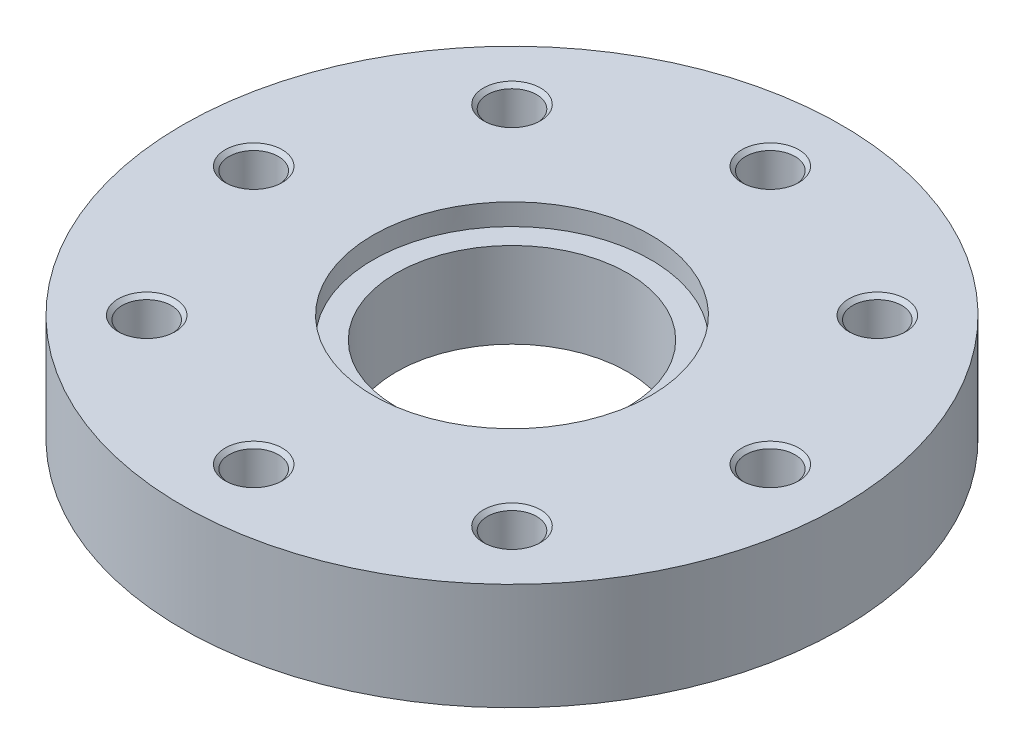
ISO-10303-21;
HEADER;
FILE_DESCRIPTION(('STEP AP214'),'2;1');
FILE_NAME('part.step','',(''),(''),'','','');
FILE_SCHEMA(('AUTOMOTIVE_DESIGN { 1 0 10303 214 1 1 1 1 }'));
ENDSEC;
DATA;
#1=APPLICATION_CONTEXT('core data for automotive mechanical design processes');
#2=APPLICATION_PROTOCOL_DEFINITION('international standard','automotive_design',2000,#1);
#3=PRODUCT_CONTEXT('',#1,'mechanical');
#4=PRODUCT('Part','Part','',(#3));
#5=PRODUCT_RELATED_PRODUCT_CATEGORY('part','',(#4));
#6=PRODUCT_DEFINITION_FORMATION('','',#4);
#7=PRODUCT_DEFINITION_CONTEXT('part definition',#1,'design');
#8=PRODUCT_DEFINITION('design','',#6,#7);
#9=PRODUCT_DEFINITION_SHAPE('','',#8);
#10=(LENGTH_UNIT() NAMED_UNIT(*) SI_UNIT(.MILLI.,.METRE.));
#11=(NAMED_UNIT(*) PLANE_ANGLE_UNIT() SI_UNIT($,.RADIAN.));
#12=(NAMED_UNIT(*) SI_UNIT($,.STERADIAN.) SOLID_ANGLE_UNIT());
#13=UNCERTAINTY_MEASURE_WITH_UNIT(LENGTH_MEASURE(1.E-05),#10,'distance_accuracy_value','');
#14=(GEOMETRIC_REPRESENTATION_CONTEXT(3) GLOBAL_UNCERTAINTY_ASSIGNED_CONTEXT((#13)) GLOBAL_UNIT_ASSIGNED_CONTEXT((#10,
#11,#12)) REPRESENTATION_CONTEXT('',''));
#15=CARTESIAN_POINT('',(0.,0.,0.));
#16=DIRECTION('',(0.,0.,1.));
#17=DIRECTION('',(1.,0.,0.));
#18=AXIS2_PLACEMENT_3D('',#15,#16,#17);
#19=CARTESIAN_POINT('',(0.,15.,0.));
#20=DIRECTION('',(0.,-1.,0.));
#21=DIRECTION('',(1.,0.,0.));
#22=AXIS2_PLACEMENT_3D('',#19,#20,#21);
#23=CYLINDRICAL_SURFACE('',#22,92.5);
#24=CARTESIAN_POINT('',(0.,0.,0.));
#25=DIRECTION('',(0.,1.,0.));
#26=DIRECTION('',(1.,0.,0.));
#27=AXIS2_PLACEMENT_3D('',#24,#25,#26);
#28=CIRCLE('',#27,92.5);
#29=CARTESIAN_POINT('',(92.5,0.,0.));
#30=VERTEX_POINT('',#29);
#31=EDGE_CURVE('E9',#30,#30,#28,.T.);
#32=ORIENTED_EDGE('',*,*,#31,.T.);
#33=EDGE_LOOP('',(#32));
#34=FACE_BOUND('',#33,.T.);
#35=CARTESIAN_POINT('',(0.,30.,0.));
#36=DIRECTION('',(0.,1.,0.));
#37=DIRECTION('',(1.,0.,0.));
#38=AXIS2_PLACEMENT_3D('',#35,#36,#37);
#39=CIRCLE('',#38,92.5);
#40=CARTESIAN_POINT('',(92.5,30.,0.));
#41=VERTEX_POINT('',#40);
#42=EDGE_CURVE('E317',#41,#41,#39,.T.);
#43=ORIENTED_EDGE('',*,*,#42,.F.);
#44=EDGE_LOOP('',(#43));
#45=FACE_BOUND('',#44,.T.);
#46=ADVANCED_FACE('F15',(#34,#45),#23,.T.);
#47=CARTESIAN_POINT('',(62.5,0.,0.));
#48=DIRECTION('',(0.,-1.,0.));
#49=DIRECTION('',(-1.,0.,0.));
#50=AXIS2_PLACEMENT_3D('',#47,#48,#49);
#51=PLANE('',#50);
#52=CARTESIAN_POINT('',(0.,0.,0.));
#53=DIRECTION('',(0.,1.,0.));
#54=DIRECTION('',(1.,0.,0.));
#55=AXIS2_PLACEMENT_3D('',#52,#53,#54);
#56=CIRCLE('',#55,32.5);
#57=CARTESIAN_POINT('',(32.5,0.,0.));
#58=VERTEX_POINT('',#57);
#59=EDGE_CURVE('E18',#58,#58,#56,.T.);
#60=ORIENTED_EDGE('',*,*,#59,.T.);
#61=EDGE_LOOP('',(#60));
#62=FACE_BOUND('',#61,.T.);
#63=ORIENTED_EDGE('',*,*,#31,.F.);
#64=EDGE_LOOP('',(#63));
#65=FACE_BOUND('',#64,.T.);
#66=ADVANCED_FACE('F323',(#62,#65),#51,.T.);
#67=CARTESIAN_POINT('',(0.,15.,0.));
#68=DIRECTION('',(0.,-1.,0.));
#69=DIRECTION('',(1.,0.,0.));
#70=AXIS2_PLACEMENT_3D('',#67,#68,#69);
#71=CYLINDRICAL_SURFACE('',#70,32.5);
#72=ORIENTED_EDGE('',*,*,#59,.F.);
#73=EDGE_LOOP('',(#72));
#74=FACE_BOUND('',#73,.T.);
#75=CARTESIAN_POINT('',(0.,24.,0.));
#76=DIRECTION('',(0.,1.,0.));
#77=DIRECTION('',(1.,0.,0.));
#78=AXIS2_PLACEMENT_3D('',#75,#76,#77);
#79=CIRCLE('',#78,32.5);
#80=CARTESIAN_POINT('',(-32.5,24.,0.));
#81=VERTEX_POINT('',#80);
#82=EDGE_CURVE('E295',#81,#81,#79,.T.);
#83=ORIENTED_EDGE('',*,*,#82,.T.);
#84=EDGE_LOOP('',(#83));
#85=FACE_BOUND('',#84,.T.);
#86=ADVANCED_FACE('F328',(#74,#85),#71,.F.);
#87=CARTESIAN_POINT('',(62.5,30.,0.));
#88=DIRECTION('',(0.,1.,0.));
#89=DIRECTION('',(1.,0.,0.));
#90=AXIS2_PLACEMENT_3D('',#87,#88,#89);
#91=PLANE('',#90);
#92=ORIENTED_EDGE('',*,*,#42,.T.);
#93=EDGE_LOOP('',(#92));
#94=FACE_BOUND('',#93,.T.);
#95=CARTESIAN_POINT('',(0.,30.,0.));
#96=DIRECTION('',(0.,-1.,0.));
#97=DIRECTION('',(1.,0.,0.));
#98=AXIS2_PLACEMENT_3D('',#95,#96,#97);
#99=CIRCLE('',#98,39.);
#100=CARTESIAN_POINT('',(-39.,30.,0.));
#101=VERTEX_POINT('',#100);
#102=EDGE_CURVE('E287',#101,#101,#99,.T.);
#103=ORIENTED_EDGE('',*,*,#102,.T.);
#104=EDGE_LOOP('',(#103));
#105=FACE_BOUND('',#104,.T.);
#106=CARTESIAN_POINT('',(72.5,30.,0.));
#107=DIRECTION('',(0.,-1.,0.));
#108=DIRECTION('',(1.,0.,0.));
#109=AXIS2_PLACEMENT_3D('',#106,#107,#108);
#110=CIRCLE('',#109,8.);
#111=CARTESIAN_POINT('',(80.5,30.,0.));
#112=VERTEX_POINT('',#111);
#113=EDGE_CURVE('E238',#112,#112,#110,.T.);
#114=ORIENTED_EDGE('',*,*,#113,.T.);
#115=EDGE_LOOP('',(#114));
#116=FACE_BOUND('',#115,.T.);
#117=CARTESIAN_POINT('',(51.2652416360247,30.,-51.2652416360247));
#118=DIRECTION('',(0.,-1.,0.));
#119=DIRECTION('',(0.707106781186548,0.,-0.707106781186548));
#120=AXIS2_PLACEMENT_3D('',#117,#118,#119);
#121=CIRCLE('',#120,8.);
#122=CARTESIAN_POINT('',(56.9220958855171,30.,-56.9220958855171));
#123=VERTEX_POINT('',#122);
#124=EDGE_CURVE('E264',#123,#123,#121,.T.);
#125=ORIENTED_EDGE('',*,*,#124,.T.);
#126=EDGE_LOOP('',(#125));
#127=FACE_BOUND('',#126,.T.);
#128=CARTESIAN_POINT('',(0.,30.,-72.5));
#129=DIRECTION('',(0.,-1.,0.));
#130=DIRECTION('',(0.,0.,-1.));
#131=AXIS2_PLACEMENT_3D('',#128,#129,#130);
#132=CIRCLE('',#131,8.);
#133=CARTESIAN_POINT('',(0.,30.,-80.5));
#134=VERTEX_POINT('',#133);
#135=EDGE_CURVE('E292',#134,#134,#132,.T.);
#136=ORIENTED_EDGE('',*,*,#135,.T.);
#137=EDGE_LOOP('',(#136));
#138=FACE_BOUND('',#137,.T.);
#139=CARTESIAN_POINT('',(-51.2652416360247,30.,-51.2652416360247));
#140=DIRECTION('',(0.,-1.,0.));
#141=DIRECTION('',(-0.707106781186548,0.,-0.707106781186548));
#142=AXIS2_PLACEMENT_3D('',#139,#140,#141);
#143=CIRCLE('',#142,8.);
#144=CARTESIAN_POINT('',(-56.9220958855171,30.,-56.9220958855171));
#145=VERTEX_POINT('',#144);
#146=EDGE_CURVE('E275',#145,#145,#143,.T.);
#147=ORIENTED_EDGE('',*,*,#146,.T.);
#148=EDGE_LOOP('',(#147));
#149=FACE_BOUND('',#148,.T.);
#150=CARTESIAN_POINT('',(-72.5,30.,0.));
#151=DIRECTION('',(0.,-1.,0.));
#152=DIRECTION('',(-1.,0.,0.));
#153=AXIS2_PLACEMENT_3D('',#150,#151,#152);
#154=CIRCLE('',#153,8.);
#155=CARTESIAN_POINT('',(-80.5,30.,0.));
#156=VERTEX_POINT('',#155);
#157=EDGE_CURVE('E258',#156,#156,#154,.T.);
#158=ORIENTED_EDGE('',*,*,#157,.T.);
#159=EDGE_LOOP('',(#158));
#160=FACE_BOUND('',#159,.T.);
#161=CARTESIAN_POINT('',(-51.2652416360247,30.,51.2652416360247));
#162=DIRECTION('',(0.,-1.,0.));
#163=DIRECTION('',(-0.707106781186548,0.,0.707106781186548));
#164=AXIS2_PLACEMENT_3D('',#161,#162,#163);
#165=CIRCLE('',#164,8.);
#166=CARTESIAN_POINT('',(-56.9220958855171,30.,56.9220958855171));
#167=VERTEX_POINT('',#166);
#168=EDGE_CURVE('E231',#167,#167,#165,.T.);
#169=ORIENTED_EDGE('',*,*,#168,.T.);
#170=EDGE_LOOP('',(#169));
#171=FACE_BOUND('',#170,.T.);
#172=CARTESIAN_POINT('',(0.,30.,72.5));
#173=DIRECTION('',(0.,-1.,0.));
#174=DIRECTION('',(0.,0.,1.));
#175=AXIS2_PLACEMENT_3D('',#172,#173,#174);
#176=CIRCLE('',#175,8.);
#177=CARTESIAN_POINT('',(0.,30.,80.5));
#178=VERTEX_POINT('',#177);
#179=EDGE_CURVE('E212',#178,#178,#176,.T.);
#180=ORIENTED_EDGE('',*,*,#179,.T.);
#181=EDGE_LOOP('',(#180));
#182=FACE_BOUND('',#181,.T.);
#183=CARTESIAN_POINT('',(51.2652416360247,30.,51.2652416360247));
#184=DIRECTION('',(0.,-1.,0.));
#185=DIRECTION('',(0.707106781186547,0.,0.707106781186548));
#186=AXIS2_PLACEMENT_3D('',#183,#184,#185);
#187=CIRCLE('',#186,8.);
#188=CARTESIAN_POINT('',(56.9220958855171,30.,56.9220958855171));
#189=VERTEX_POINT('',#188);
#190=EDGE_CURVE('E228',#189,#189,#187,.T.);
#191=ORIENTED_EDGE('',*,*,#190,.T.);
#192=EDGE_LOOP('',(#191));
#193=FACE_BOUND('',#192,.T.);
#194=ADVANCED_FACE('F213',(#94,#105,#116,#127,#138,#149,#160,#171,#182,#193),#91,.T.);
#195=CARTESIAN_POINT('',(0.,24.,0.));
#196=DIRECTION('',(0.,-1.,0.));
#197=DIRECTION('',(-1.,0.,0.));
#198=AXIS2_PLACEMENT_3D('',#195,#196,#197);
#199=PLANE('',#198);
#200=CARTESIAN_POINT('',(0.,24.,0.));
#201=DIRECTION('',(0.,-1.,0.));
#202=DIRECTION('',(1.,0.,0.));
#203=AXIS2_PLACEMENT_3D('',#200,#201,#202);
#204=CIRCLE('',#203,39.);
#205=CARTESIAN_POINT('',(39.,24.,0.));
#206=VERTEX_POINT('',#205);
#207=EDGE_CURVE('E293',#206,#206,#204,.T.);
#208=ORIENTED_EDGE('',*,*,#207,.F.);
#209=EDGE_LOOP('',(#208));
#210=FACE_BOUND('',#209,.T.);
#211=ORIENTED_EDGE('',*,*,#82,.F.);
#212=EDGE_LOOP('',(#211));
#213=FACE_BOUND('',#212,.T.);
#214=ADVANCED_FACE('F338',(#210,#213),#199,.F.);
#215=CARTESIAN_POINT('',(0.,28.5,0.));
#216=DIRECTION('',(0.,-1.,0.));
#217=DIRECTION('',(1.,0.,0.));
#218=AXIS2_PLACEMENT_3D('',#215,#216,#217);
#219=CYLINDRICAL_SURFACE('',#218,39.);
#220=ORIENTED_EDGE('',*,*,#207,.T.);
#221=EDGE_LOOP('',(#220));
#222=FACE_BOUND('',#221,.T.);
#223=ORIENTED_EDGE('',*,*,#102,.F.);
#224=EDGE_LOOP('',(#223));
#225=FACE_BOUND('',#224,.T.);
#226=ADVANCED_FACE('F341',(#222,#225),#219,.F.);
#227=CARTESIAN_POINT('',(72.5,5.00308975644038,0.));
#228=DIRECTION('',(0.,1.,0.));
#229=DIRECTION('',(1.,0.,0.));
#230=AXIS2_PLACEMENT_3D('',#227,#228,#229);
#231=CONICAL_SURFACE('',#230,3.45875,1.0471975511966);
#232=CARTESIAN_POINT('',(72.5,7.,0.));
#233=DIRECTION('',(0.,-1.,0.));
#234=DIRECTION('',(1.,0.,0.));
#235=AXIS2_PLACEMENT_3D('',#232,#233,#234);
#236=CIRCLE('',#235,6.9175);
#237=CARTESIAN_POINT('',(79.4175,7.,0.));
#238=VERTEX_POINT('',#237);
#239=EDGE_CURVE('E285',#238,#238,#236,.T.);
#240=ORIENTED_EDGE('',*,*,#239,.F.);
#241=EDGE_LOOP('',(#240));
#242=FACE_BOUND('',#241,.T.);
#243=CARTESIAN_POINT('',(72.5,3.00617951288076,0.));
#244=VERTEX_POINT('',#243);
#245=VERTEX_LOOP('',#244);
#246=FACE_BOUND('',#245,.T.);
#247=ADVANCED_FACE('F343',(#242,#246),#231,.F.);
#248=CARTESIAN_POINT('',(72.5,9.95875,0.));
#249=DIRECTION('',(0.,1.,0.));
#250=DIRECTION('',(1.,0.,0.));
#251=AXIS2_PLACEMENT_3D('',#248,#249,#250);
#252=CYLINDRICAL_SURFACE('',#251,6.9175);
#253=CARTESIAN_POINT('',(72.5,12.9175,0.));
#254=DIRECTION('',(0.,-1.,0.));
#255=DIRECTION('',(1.,0.,0.));
#256=AXIS2_PLACEMENT_3D('',#253,#254,#255);
#257=CIRCLE('',#256,6.9175);
#258=CARTESIAN_POINT('',(79.4175,12.9175,0.));
#259=VERTEX_POINT('',#258);
#260=EDGE_CURVE('E288',#259,#259,#257,.T.);
#261=ORIENTED_EDGE('',*,*,#260,.F.);
#262=EDGE_LOOP('',(#261));
#263=FACE_BOUND('',#262,.T.);
#264=ORIENTED_EDGE('',*,*,#239,.T.);
#265=EDGE_LOOP('',(#264));
#266=FACE_BOUND('',#265,.T.);
#267=ADVANCED_FACE('F346',(#263,#266),#252,.F.);
#268=CARTESIAN_POINT('',(72.5,13.45875,0.));
#269=DIRECTION('',(0.,1.,0.));
#270=DIRECTION('',(1.,0.,0.));
#271=AXIS2_PLACEMENT_3D('',#268,#269,#270);
#272=CONICAL_SURFACE('',#271,7.45875,0.785398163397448);
#273=CARTESIAN_POINT('',(72.5,14.,0.));
#274=DIRECTION('',(0.,-1.,0.));
#275=DIRECTION('',(1.,0.,0.));
#276=AXIS2_PLACEMENT_3D('',#273,#274,#275);
#277=CIRCLE('',#276,8.);
#278=CARTESIAN_POINT('',(80.5,14.,0.));
#279=VERTEX_POINT('',#278);
#280=EDGE_CURVE('E313',#279,#279,#277,.T.);
#281=ORIENTED_EDGE('',*,*,#280,.F.);
#282=EDGE_LOOP('',(#281));
#283=FACE_BOUND('',#282,.T.);
#284=ORIENTED_EDGE('',*,*,#260,.T.);
#285=EDGE_LOOP('',(#284));
#286=FACE_BOUND('',#285,.T.);
#287=ADVANCED_FACE('F350',(#283,#286),#272,.F.);
#288=CARTESIAN_POINT('',(79.95875,14.,0.));
#289=DIRECTION('',(0.,1.,0.));
#290=DIRECTION('',(-1.,0.,0.));
#291=AXIS2_PLACEMENT_3D('',#288,#289,#290);
#292=PLANE('',#291);
#293=CARTESIAN_POINT('',(72.5,14.,0.));
#294=DIRECTION('',(0.,-1.,0.));
#295=DIRECTION('',(1.,0.,0.));
#296=AXIS2_PLACEMENT_3D('',#293,#294,#295);
#297=CIRCLE('',#296,6.9175);
#298=CARTESIAN_POINT('',(79.4175,14.,0.));
#299=VERTEX_POINT('',#298);
#300=EDGE_CURVE('E239',#299,#299,#297,.T.);
#301=ORIENTED_EDGE('',*,*,#300,.F.);
#302=EDGE_LOOP('',(#301));
#303=FACE_BOUND('',#302,.T.);
#304=ORIENTED_EDGE('',*,*,#280,.T.);
#305=EDGE_LOOP('',(#304));
#306=FACE_BOUND('',#305,.T.);
#307=ADVANCED_FACE('F354',(#303,#306),#292,.F.);
#308=CARTESIAN_POINT('',(72.5,21.45875,0.));
#309=DIRECTION('',(0.,1.,0.));
#310=DIRECTION('',(1.,0.,0.));
#311=AXIS2_PLACEMENT_3D('',#308,#309,#310);
#312=CYLINDRICAL_SURFACE('',#311,6.9175);
#313=CARTESIAN_POINT('',(72.5,28.9175,0.));
#314=DIRECTION('',(0.,-1.,0.));
#315=DIRECTION('',(1.,0.,0.));
#316=AXIS2_PLACEMENT_3D('',#313,#314,#315);
#317=CIRCLE('',#316,6.9175);
#318=CARTESIAN_POINT('',(79.4175,28.9175,0.));
#319=VERTEX_POINT('',#318);
#320=EDGE_CURVE('E240',#319,#319,#317,.T.);
#321=ORIENTED_EDGE('',*,*,#320,.F.);
#322=EDGE_LOOP('',(#321));
#323=FACE_BOUND('',#322,.T.);
#324=ORIENTED_EDGE('',*,*,#300,.T.);
#325=EDGE_LOOP('',(#324));
#326=FACE_BOUND('',#325,.T.);
#327=ADVANCED_FACE('F358',(#323,#326),#312,.F.);
#328=CARTESIAN_POINT('',(72.5,29.45875,0.));
#329=DIRECTION('',(0.,1.,0.));
#330=DIRECTION('',(1.,0.,0.));
#331=AXIS2_PLACEMENT_3D('',#328,#329,#330);
#332=CONICAL_SURFACE('',#331,7.45875,0.785398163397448);
#333=ORIENTED_EDGE('',*,*,#113,.F.);
#334=EDGE_LOOP('',(#333));
#335=FACE_BOUND('',#334,.T.);
#336=ORIENTED_EDGE('',*,*,#320,.T.);
#337=EDGE_LOOP('',(#336));
#338=FACE_BOUND('',#337,.T.);
#339=ADVANCED_FACE('F360',(#335,#338),#332,.F.);
#340=CARTESIAN_POINT('',(51.2652416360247,5.00308975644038,-51.2652416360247));
#341=DIRECTION('',(0.,1.,0.));
#342=DIRECTION('',(0.707106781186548,0.,-0.707106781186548));
#343=AXIS2_PLACEMENT_3D('',#340,#341,#342);
#344=CONICAL_SURFACE('',#343,3.45875,1.0471975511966);
#345=CARTESIAN_POINT('',(51.2652416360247,7.,-51.2652416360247));
#346=DIRECTION('',(0.,-1.,0.));
#347=DIRECTION('',(0.707106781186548,0.,-0.707106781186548));
#348=AXIS2_PLACEMENT_3D('',#345,#346,#347);
#349=CIRCLE('',#348,6.9175);
#350=CARTESIAN_POINT('',(56.1566527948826,7.,-56.1566527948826));
#351=VERTEX_POINT('',#350);
#352=EDGE_CURVE('E274',#351,#351,#349,.T.);
#353=ORIENTED_EDGE('',*,*,#352,.F.);
#354=EDGE_LOOP('',(#353));
#355=FACE_BOUND('',#354,.T.);
#356=CARTESIAN_POINT('',(51.2652416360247,3.00617951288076,-51.2652416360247));
#357=VERTEX_POINT('',#356);
#358=VERTEX_LOOP('',#357);
#359=FACE_BOUND('',#358,.T.);
#360=ADVANCED_FACE('F363',(#355,#359),#344,.F.);
#361=CARTESIAN_POINT('',(51.2652416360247,9.95875,-51.2652416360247));
#362=DIRECTION('',(0.,1.,0.));
#363=DIRECTION('',(0.707106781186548,0.,-0.707106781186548));
#364=AXIS2_PLACEMENT_3D('',#361,#362,#363);
#365=CYLINDRICAL_SURFACE('',#364,6.9175);
#366=CARTESIAN_POINT('',(51.2652416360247,12.9175,-51.2652416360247));
#367=DIRECTION('',(0.,-1.,0.));
#368=DIRECTION('',(0.707106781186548,0.,-0.707106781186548));
#369=AXIS2_PLACEMENT_3D('',#366,#367,#368);
#370=CIRCLE('',#369,6.9175);
#371=CARTESIAN_POINT('',(56.1566527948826,12.9175,-56.1566527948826));
#372=VERTEX_POINT('',#371);
#373=EDGE_CURVE('E309',#372,#372,#370,.T.);
#374=ORIENTED_EDGE('',*,*,#373,.F.);
#375=EDGE_LOOP('',(#374));
#376=FACE_BOUND('',#375,.T.);
#377=ORIENTED_EDGE('',*,*,#352,.T.);
#378=EDGE_LOOP('',(#377));
#379=FACE_BOUND('',#378,.T.);
#380=ADVANCED_FACE('F367',(#376,#379),#365,.F.);
#381=CARTESIAN_POINT('',(51.2652416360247,13.45875,-51.2652416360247));
#382=DIRECTION('',(0.,1.,0.));
#383=DIRECTION('',(0.707106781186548,0.,-0.707106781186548));
#384=AXIS2_PLACEMENT_3D('',#381,#382,#383);
#385=CONICAL_SURFACE('',#384,7.45875,0.785398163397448);
#386=CARTESIAN_POINT('',(51.2652416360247,14.,-51.2652416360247));
#387=DIRECTION('',(0.,-1.,0.));
#388=DIRECTION('',(0.707106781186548,0.,-0.707106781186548));
#389=AXIS2_PLACEMENT_3D('',#386,#387,#388);
#390=CIRCLE('',#389,8.);
#391=CARTESIAN_POINT('',(56.9220958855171,14.,-56.9220958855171));
#392=VERTEX_POINT('',#391);
#393=EDGE_CURVE('E263',#392,#392,#390,.T.);
#394=ORIENTED_EDGE('',*,*,#393,.F.);
#395=EDGE_LOOP('',(#394));
#396=FACE_BOUND('',#395,.T.);
#397=ORIENTED_EDGE('',*,*,#373,.T.);
#398=EDGE_LOOP('',(#397));
#399=FACE_BOUND('',#398,.T.);
#400=ADVANCED_FACE('F371',(#396,#399),#385,.F.);
#401=CARTESIAN_POINT('',(56.5393743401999,14.,-56.5393743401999));
#402=DIRECTION('',(0.,1.,0.));
#403=DIRECTION('',(-0.707106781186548,0.,0.707106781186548));
#404=AXIS2_PLACEMENT_3D('',#401,#402,#403);
#405=PLANE('',#404);
#406=CARTESIAN_POINT('',(51.2652416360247,14.,-51.2652416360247));
#407=DIRECTION('',(0.,-1.,0.));
#408=DIRECTION('',(0.707106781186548,0.,-0.707106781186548));
#409=AXIS2_PLACEMENT_3D('',#406,#407,#408);
#410=CIRCLE('',#409,6.9175);
#411=CARTESIAN_POINT('',(56.1566527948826,14.,-56.1566527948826));
#412=VERTEX_POINT('',#411);
#413=EDGE_CURVE('E261',#412,#412,#410,.T.);
#414=ORIENTED_EDGE('',*,*,#413,.F.);
#415=EDGE_LOOP('',(#414));
#416=FACE_BOUND('',#415,.T.);
#417=ORIENTED_EDGE('',*,*,#393,.T.);
#418=EDGE_LOOP('',(#417));
#419=FACE_BOUND('',#418,.T.);
#420=ADVANCED_FACE('F373',(#416,#419),#405,.F.);
#421=CARTESIAN_POINT('',(51.2652416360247,21.45875,-51.2652416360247));
#422=DIRECTION('',(0.,1.,0.));
#423=DIRECTION('',(0.707106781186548,0.,-0.707106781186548));
#424=AXIS2_PLACEMENT_3D('',#421,#422,#423);
#425=CYLINDRICAL_SURFACE('',#424,6.9175);
#426=CARTESIAN_POINT('',(51.2652416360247,28.9175,-51.2652416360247));
#427=DIRECTION('',(0.,-1.,0.));
#428=DIRECTION('',(0.707106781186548,0.,-0.707106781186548));
#429=AXIS2_PLACEMENT_3D('',#426,#427,#428);
#430=CIRCLE('',#429,6.9175);
#431=CARTESIAN_POINT('',(56.1566527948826,28.9175,-56.1566527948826));
#432=VERTEX_POINT('',#431);
#433=EDGE_CURVE('E305',#432,#432,#430,.T.);
#434=ORIENTED_EDGE('',*,*,#433,.F.);
#435=EDGE_LOOP('',(#434));
#436=FACE_BOUND('',#435,.T.);
#437=ORIENTED_EDGE('',*,*,#413,.T.);
#438=EDGE_LOOP('',(#437));
#439=FACE_BOUND('',#438,.T.);
#440=ADVANCED_FACE('F376',(#436,#439),#425,.F.);
#441=CARTESIAN_POINT('',(51.2652416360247,29.45875,-51.2652416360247));
#442=DIRECTION('',(0.,1.,0.));
#443=DIRECTION('',(0.707106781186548,0.,-0.707106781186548));
#444=AXIS2_PLACEMENT_3D('',#441,#442,#443);
#445=CONICAL_SURFACE('',#444,7.45875,0.785398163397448);
#446=ORIENTED_EDGE('',*,*,#124,.F.);
#447=EDGE_LOOP('',(#446));
#448=FACE_BOUND('',#447,.T.);
#449=ORIENTED_EDGE('',*,*,#433,.T.);
#450=EDGE_LOOP('',(#449));
#451=FACE_BOUND('',#450,.T.);
#452=ADVANCED_FACE('F380',(#448,#451),#445,.F.);
#453=CARTESIAN_POINT('',(0.,5.00308975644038,-72.5));
#454=DIRECTION('',(0.,1.,0.));
#455=DIRECTION('',(0.,0.,-1.));
#456=AXIS2_PLACEMENT_3D('',#453,#454,#455);
#457=CONICAL_SURFACE('',#456,3.45875,1.0471975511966);
#458=CARTESIAN_POINT('',(0.,7.,-72.5));
#459=DIRECTION('',(0.,-1.,0.));
#460=DIRECTION('',(0.,0.,-1.));
#461=AXIS2_PLACEMENT_3D('',#458,#459,#460);
#462=CIRCLE('',#461,6.9175);
#463=CARTESIAN_POINT('',(0.,7.,-79.4175));
#464=VERTEX_POINT('',#463);
#465=EDGE_CURVE('E303',#464,#464,#462,.T.);
#466=ORIENTED_EDGE('',*,*,#465,.F.);
#467=EDGE_LOOP('',(#466));
#468=FACE_BOUND('',#467,.T.);
#469=CARTESIAN_POINT('',(0.,3.00617951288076,-72.5));
#470=VERTEX_POINT('',#469);
#471=VERTEX_LOOP('',#470);
#472=FACE_BOUND('',#471,.T.);
#473=ADVANCED_FACE('F384',(#468,#472),#457,.F.);
#474=CARTESIAN_POINT('',(0.,9.95875,-72.5));
#475=DIRECTION('',(0.,1.,0.));
#476=DIRECTION('',(0.,0.,-1.));
#477=AXIS2_PLACEMENT_3D('',#474,#475,#476);
#478=CYLINDRICAL_SURFACE('',#477,6.9175);
#479=CARTESIAN_POINT('',(0.,12.9175,-72.5));
#480=DIRECTION('',(0.,-1.,0.));
#481=DIRECTION('',(0.,0.,-1.));
#482=AXIS2_PLACEMENT_3D('',#479,#480,#481);
#483=CIRCLE('',#482,6.9175);
#484=CARTESIAN_POINT('',(0.,12.9175,-79.4175));
#485=VERTEX_POINT('',#484);
#486=EDGE_CURVE('E301',#485,#485,#483,.T.);
#487=ORIENTED_EDGE('',*,*,#486,.F.);
#488=EDGE_LOOP('',(#487));
#489=FACE_BOUND('',#488,.T.);
#490=ORIENTED_EDGE('',*,*,#465,.T.);
#491=EDGE_LOOP('',(#490));
#492=FACE_BOUND('',#491,.T.);
#493=ADVANCED_FACE('F388',(#489,#492),#478,.F.);
#494=CARTESIAN_POINT('',(0.,13.45875,-72.5));
#495=DIRECTION('',(0.,1.,0.));
#496=DIRECTION('',(0.,0.,-1.));
#497=AXIS2_PLACEMENT_3D('',#494,#495,#496);
#498=CONICAL_SURFACE('',#497,7.45875,0.785398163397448);
#499=CARTESIAN_POINT('',(0.,14.,-72.5));
#500=DIRECTION('',(0.,-1.,0.));
#501=DIRECTION('',(0.,0.,-1.));
#502=AXIS2_PLACEMENT_3D('',#499,#500,#501);
#503=CIRCLE('',#502,8.);
#504=CARTESIAN_POINT('',(0.,14.,-80.5));
#505=VERTEX_POINT('',#504);
#506=EDGE_CURVE('E299',#505,#505,#503,.T.);
#507=ORIENTED_EDGE('',*,*,#506,.F.);
#508=EDGE_LOOP('',(#507));
#509=FACE_BOUND('',#508,.T.);
#510=ORIENTED_EDGE('',*,*,#486,.T.);
#511=EDGE_LOOP('',(#510));
#512=FACE_BOUND('',#511,.T.);
#513=ADVANCED_FACE('F392',(#509,#512),#498,.F.);
#514=CARTESIAN_POINT('',(0.,14.,-79.95875));
#515=DIRECTION('',(0.,1.,0.));
#516=DIRECTION('',(0.,0.,1.));
#517=AXIS2_PLACEMENT_3D('',#514,#515,#516);
#518=PLANE('',#517);
#519=CARTESIAN_POINT('',(0.,14.,-72.5));
#520=DIRECTION('',(0.,-1.,0.));
#521=DIRECTION('',(0.,0.,-1.));
#522=AXIS2_PLACEMENT_3D('',#519,#520,#521);
#523=CIRCLE('',#522,6.9175);
#524=CARTESIAN_POINT('',(0.,14.,-79.4175));
#525=VERTEX_POINT('',#524);
#526=EDGE_CURVE('E297',#525,#525,#523,.T.);
#527=ORIENTED_EDGE('',*,*,#526,.F.);
#528=EDGE_LOOP('',(#527));
#529=FACE_BOUND('',#528,.T.);
#530=ORIENTED_EDGE('',*,*,#506,.T.);
#531=EDGE_LOOP('',(#530));
#532=FACE_BOUND('',#531,.T.);
#533=ADVANCED_FACE('F396',(#529,#532),#518,.F.);
#534=CARTESIAN_POINT('',(0.,21.45875,-72.5));
#535=DIRECTION('',(0.,1.,0.));
#536=DIRECTION('',(0.,0.,-1.));
#537=AXIS2_PLACEMENT_3D('',#534,#535,#536);
#538=CYLINDRICAL_SURFACE('',#537,6.9175);
#539=CARTESIAN_POINT('',(0.,28.9175,-72.5));
#540=DIRECTION('',(0.,-1.,0.));
#541=DIRECTION('',(0.,0.,-1.));
#542=AXIS2_PLACEMENT_3D('',#539,#540,#541);
#543=CIRCLE('',#542,6.9175);
#544=CARTESIAN_POINT('',(0.,28.9175,-79.4175));
#545=VERTEX_POINT('',#544);
#546=EDGE_CURVE('E290',#545,#545,#543,.T.);
#547=ORIENTED_EDGE('',*,*,#546,.F.);
#548=EDGE_LOOP('',(#547));
#549=FACE_BOUND('',#548,.T.);
#550=ORIENTED_EDGE('',*,*,#526,.T.);
#551=EDGE_LOOP('',(#550));
#552=FACE_BOUND('',#551,.T.);
#553=ADVANCED_FACE('F400',(#549,#552),#538,.F.);
#554=CARTESIAN_POINT('',(0.,29.45875,-72.5));
#555=DIRECTION('',(0.,1.,0.));
#556=DIRECTION('',(0.,0.,-1.));
#557=AXIS2_PLACEMENT_3D('',#554,#555,#556);
#558=CONICAL_SURFACE('',#557,7.45875,0.785398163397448);
#559=ORIENTED_EDGE('',*,*,#135,.F.);
#560=EDGE_LOOP('',(#559));
#561=FACE_BOUND('',#560,.T.);
#562=ORIENTED_EDGE('',*,*,#546,.T.);
#563=EDGE_LOOP('',(#562));
#564=FACE_BOUND('',#563,.T.);
#565=ADVANCED_FACE('F404',(#561,#564),#558,.F.);
#566=CARTESIAN_POINT('',(-51.2652416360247,5.00308975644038,-51.2652416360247));
#567=DIRECTION('',(0.,1.,0.));
#568=DIRECTION('',(-0.707106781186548,0.,-0.707106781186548));
#569=AXIS2_PLACEMENT_3D('',#566,#567,#568);
#570=CONICAL_SURFACE('',#569,3.45875,1.0471975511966);
#571=CARTESIAN_POINT('',(-51.2652416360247,7.,-51.2652416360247));
#572=DIRECTION('',(0.,-1.,0.));
#573=DIRECTION('',(-0.707106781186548,0.,-0.707106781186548));
#574=AXIS2_PLACEMENT_3D('',#571,#572,#573);
#575=CIRCLE('',#574,6.9175);
#576=CARTESIAN_POINT('',(-56.1566527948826,7.,-56.1566527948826));
#577=VERTEX_POINT('',#576);
#578=EDGE_CURVE('E284',#577,#577,#575,.T.);
#579=ORIENTED_EDGE('',*,*,#578,.F.);
#580=EDGE_LOOP('',(#579));
#581=FACE_BOUND('',#580,.T.);
#582=CARTESIAN_POINT('',(-51.2652416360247,3.00617951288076,-51.2652416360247));
#583=VERTEX_POINT('',#582);
#584=VERTEX_LOOP('',#583);
#585=FACE_BOUND('',#584,.T.);
#586=ADVANCED_FACE('F408',(#581,#585),#570,.F.);
#587=CARTESIAN_POINT('',(-51.2652416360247,9.95875,-51.2652416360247));
#588=DIRECTION('',(0.,1.,0.));
#589=DIRECTION('',(-0.707106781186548,0.,-0.707106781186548));
#590=AXIS2_PLACEMENT_3D('',#587,#588,#589);
#591=CYLINDRICAL_SURFACE('',#590,6.9175);
#592=CARTESIAN_POINT('',(-51.2652416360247,12.9175,-51.2652416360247));
#593=DIRECTION('',(0.,-1.,0.));
#594=DIRECTION('',(-0.707106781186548,0.,-0.707106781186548));
#595=AXIS2_PLACEMENT_3D('',#592,#593,#594);
#596=CIRCLE('',#595,6.9175);
#597=CARTESIAN_POINT('',(-56.1566527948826,12.9175,-56.1566527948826));
#598=VERTEX_POINT('',#597);
#599=EDGE_CURVE('E282',#598,#598,#596,.T.);
#600=ORIENTED_EDGE('',*,*,#599,.F.);
#601=EDGE_LOOP('',(#600));
#602=FACE_BOUND('',#601,.T.);
#603=ORIENTED_EDGE('',*,*,#578,.T.);
#604=EDGE_LOOP('',(#603));
#605=FACE_BOUND('',#604,.T.);
#606=ADVANCED_FACE('F415',(#602,#605),#591,.F.);
#607=CARTESIAN_POINT('',(-51.2652416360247,13.45875,-51.2652416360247));
#608=DIRECTION('',(0.,1.,0.));
#609=DIRECTION('',(-0.707106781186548,0.,-0.707106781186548));
#610=AXIS2_PLACEMENT_3D('',#607,#608,#609);
#611=CONICAL_SURFACE('',#610,7.45875,0.785398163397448);
#612=CARTESIAN_POINT('',(-51.2652416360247,14.,-51.2652416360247));
#613=DIRECTION('',(0.,-1.,0.));
#614=DIRECTION('',(-0.707106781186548,0.,-0.707106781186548));
#615=AXIS2_PLACEMENT_3D('',#612,#613,#614);
#616=CIRCLE('',#615,8.);
#617=CARTESIAN_POINT('',(-56.9220958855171,14.,-56.9220958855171));
#618=VERTEX_POINT('',#617);
#619=EDGE_CURVE('E280',#618,#618,#616,.T.);
#620=ORIENTED_EDGE('',*,*,#619,.F.);
#621=EDGE_LOOP('',(#620));
#622=FACE_BOUND('',#621,.T.);
#623=ORIENTED_EDGE('',*,*,#599,.T.);
#624=EDGE_LOOP('',(#623));
#625=FACE_BOUND('',#624,.T.);
#626=ADVANCED_FACE('F419',(#622,#625),#611,.F.);
#627=CARTESIAN_POINT('',(-56.5393743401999,14.,-56.5393743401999));
#628=DIRECTION('',(0.,1.,0.));
#629=DIRECTION('',(0.707106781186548,0.,0.707106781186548));
#630=AXIS2_PLACEMENT_3D('',#627,#628,#629);
#631=PLANE('',#630);
#632=CARTESIAN_POINT('',(-51.2652416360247,14.,-51.2652416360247));
#633=DIRECTION('',(0.,-1.,0.));
#634=DIRECTION('',(-0.707106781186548,0.,-0.707106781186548));
#635=AXIS2_PLACEMENT_3D('',#632,#633,#634);
#636=CIRCLE('',#635,6.9175);
#637=CARTESIAN_POINT('',(-56.1566527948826,14.,-56.1566527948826));
#638=VERTEX_POINT('',#637);
#639=EDGE_CURVE('E278',#638,#638,#636,.T.);
#640=ORIENTED_EDGE('',*,*,#639,.F.);
#641=EDGE_LOOP('',(#640));
#642=FACE_BOUND('',#641,.T.);
#643=ORIENTED_EDGE('',*,*,#619,.T.);
#644=EDGE_LOOP('',(#643));
#645=FACE_BOUND('',#644,.T.);
#646=ADVANCED_FACE('F423',(#642,#645),#631,.F.);
#647=CARTESIAN_POINT('',(-51.2652416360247,21.45875,-51.2652416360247));
#648=DIRECTION('',(0.,1.,0.));
#649=DIRECTION('',(-0.707106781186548,0.,-0.707106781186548));
#650=AXIS2_PLACEMENT_3D('',#647,#648,#649);
#651=CYLINDRICAL_SURFACE('',#650,6.9175);
#652=CARTESIAN_POINT('',(-51.2652416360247,28.9175,-51.2652416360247));
#653=DIRECTION('',(0.,-1.,0.));
#654=DIRECTION('',(-0.707106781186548,0.,-0.707106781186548));
#655=AXIS2_PLACEMENT_3D('',#652,#653,#654);
#656=CIRCLE('',#655,6.9175);
#657=CARTESIAN_POINT('',(-56.1566527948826,28.9175,-56.1566527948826));
#658=VERTEX_POINT('',#657);
#659=EDGE_CURVE('E272',#658,#658,#656,.T.);
#660=ORIENTED_EDGE('',*,*,#659,.F.);
#661=EDGE_LOOP('',(#660));
#662=FACE_BOUND('',#661,.T.);
#663=ORIENTED_EDGE('',*,*,#639,.T.);
#664=EDGE_LOOP('',(#663));
#665=FACE_BOUND('',#664,.T.);
#666=ADVANCED_FACE('F427',(#662,#665),#651,.F.);
#667=CARTESIAN_POINT('',(-51.2652416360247,29.45875,-51.2652416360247));
#668=DIRECTION('',(0.,1.,0.));
#669=DIRECTION('',(-0.707106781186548,0.,-0.707106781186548));
#670=AXIS2_PLACEMENT_3D('',#667,#668,#669);
#671=CONICAL_SURFACE('',#670,7.45875,0.785398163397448);
#672=ORIENTED_EDGE('',*,*,#146,.F.);
#673=EDGE_LOOP('',(#672));
#674=FACE_BOUND('',#673,.T.);
#675=ORIENTED_EDGE('',*,*,#659,.T.);
#676=EDGE_LOOP('',(#675));
#677=FACE_BOUND('',#676,.T.);
#678=ADVANCED_FACE('F431',(#674,#677),#671,.F.);
#679=CARTESIAN_POINT('',(-72.5,5.00308975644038,0.));
#680=DIRECTION('',(0.,1.,0.));
#681=DIRECTION('',(-1.,0.,0.));
#682=AXIS2_PLACEMENT_3D('',#679,#680,#681);
#683=CONICAL_SURFACE('',#682,3.45875,1.0471975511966);
#684=CARTESIAN_POINT('',(-72.5,7.,0.));
#685=DIRECTION('',(0.,-1.,0.));
#686=DIRECTION('',(-1.,0.,0.));
#687=AXIS2_PLACEMENT_3D('',#684,#685,#686);
#688=CIRCLE('',#687,6.9175);
#689=CARTESIAN_POINT('',(-79.4175,7.,0.));
#690=VERTEX_POINT('',#689);
#691=EDGE_CURVE('E270',#690,#690,#688,.T.);
#692=ORIENTED_EDGE('',*,*,#691,.F.);
#693=EDGE_LOOP('',(#692));
#694=FACE_BOUND('',#693,.T.);
#695=CARTESIAN_POINT('',(-72.5,3.00617951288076,0.));
#696=VERTEX_POINT('',#695);
#697=VERTEX_LOOP('',#696);
#698=FACE_BOUND('',#697,.T.);
#699=ADVANCED_FACE('F438',(#694,#698),#683,.F.);
#700=CARTESIAN_POINT('',(-72.5,9.95875,0.));
#701=DIRECTION('',(0.,1.,0.));
#702=DIRECTION('',(-1.,0.,0.));
#703=AXIS2_PLACEMENT_3D('',#700,#701,#702);
#704=CYLINDRICAL_SURFACE('',#703,6.9175);
#705=CARTESIAN_POINT('',(-72.5,12.9175,0.));
#706=DIRECTION('',(0.,-1.,0.));
#707=DIRECTION('',(-1.,0.,0.));
#708=AXIS2_PLACEMENT_3D('',#705,#706,#707);
#709=CIRCLE('',#708,6.9175);
#710=CARTESIAN_POINT('',(-79.4175,12.9175,0.));
#711=VERTEX_POINT('',#710);
#712=EDGE_CURVE('E268',#711,#711,#709,.T.);
#713=ORIENTED_EDGE('',*,*,#712,.F.);
#714=EDGE_LOOP('',(#713));
#715=FACE_BOUND('',#714,.T.);
#716=ORIENTED_EDGE('',*,*,#691,.T.);
#717=EDGE_LOOP('',(#716));
#718=FACE_BOUND('',#717,.T.);
#719=ADVANCED_FACE('F442',(#715,#718),#704,.F.);
#720=CARTESIAN_POINT('',(-72.5,13.45875,0.));
#721=DIRECTION('',(0.,1.,0.));
#722=DIRECTION('',(-1.,0.,0.));
#723=AXIS2_PLACEMENT_3D('',#720,#721,#722);
#724=CONICAL_SURFACE('',#723,7.45875,0.785398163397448);
#725=CARTESIAN_POINT('',(-72.5,14.,0.));
#726=DIRECTION('',(0.,-1.,0.));
#727=DIRECTION('',(-1.,0.,0.));
#728=AXIS2_PLACEMENT_3D('',#725,#726,#727);
#729=CIRCLE('',#728,8.);
#730=CARTESIAN_POINT('',(-80.5,14.,0.));
#731=VERTEX_POINT('',#730);
#732=EDGE_CURVE('E266',#731,#731,#729,.T.);
#733=ORIENTED_EDGE('',*,*,#732,.F.);
#734=EDGE_LOOP('',(#733));
#735=FACE_BOUND('',#734,.T.);
#736=ORIENTED_EDGE('',*,*,#712,.T.);
#737=EDGE_LOOP('',(#736));
#738=FACE_BOUND('',#737,.T.);
#739=ADVANCED_FACE('F446',(#735,#738),#724,.F.);
#740=CARTESIAN_POINT('',(-79.95875,14.,0.));
#741=DIRECTION('',(0.,1.,0.));
#742=DIRECTION('',(1.,0.,0.));
#743=AXIS2_PLACEMENT_3D('',#740,#741,#742);
#744=PLANE('',#743);
#745=CARTESIAN_POINT('',(-72.5,14.,0.));
#746=DIRECTION('',(0.,-1.,0.));
#747=DIRECTION('',(-1.,0.,0.));
#748=AXIS2_PLACEMENT_3D('',#745,#746,#747);
#749=CIRCLE('',#748,6.9175);
#750=CARTESIAN_POINT('',(-79.4175,14.,0.));
#751=VERTEX_POINT('',#750);
#752=EDGE_CURVE('E260',#751,#751,#749,.T.);
#753=ORIENTED_EDGE('',*,*,#752,.F.);
#754=EDGE_LOOP('',(#753));
#755=FACE_BOUND('',#754,.T.);
#756=ORIENTED_EDGE('',*,*,#732,.T.);
#757=EDGE_LOOP('',(#756));
#758=FACE_BOUND('',#757,.T.);
#759=ADVANCED_FACE('F450',(#755,#758),#744,.F.);
#760=CARTESIAN_POINT('',(-72.5,21.45875,0.));
#761=DIRECTION('',(0.,1.,0.));
#762=DIRECTION('',(-1.,0.,0.));
#763=AXIS2_PLACEMENT_3D('',#760,#761,#762);
#764=CYLINDRICAL_SURFACE('',#763,6.9175);
#765=CARTESIAN_POINT('',(-72.5,28.9175,0.));
#766=DIRECTION('',(0.,-1.,0.));
#767=DIRECTION('',(-1.,0.,0.));
#768=AXIS2_PLACEMENT_3D('',#765,#766,#767);
#769=CIRCLE('',#768,6.9175);
#770=CARTESIAN_POINT('',(-79.4175,28.9175,0.));
#771=VERTEX_POINT('',#770);
#772=EDGE_CURVE('E256',#771,#771,#769,.T.);
#773=ORIENTED_EDGE('',*,*,#772,.F.);
#774=EDGE_LOOP('',(#773));
#775=FACE_BOUND('',#774,.T.);
#776=ORIENTED_EDGE('',*,*,#752,.T.);
#777=EDGE_LOOP('',(#776));
#778=FACE_BOUND('',#777,.T.);
#779=ADVANCED_FACE('F454',(#775,#778),#764,.F.);
#780=CARTESIAN_POINT('',(-72.5,29.45875,0.));
#781=DIRECTION('',(0.,1.,0.));
#782=DIRECTION('',(-1.,0.,0.));
#783=AXIS2_PLACEMENT_3D('',#780,#781,#782);
#784=CONICAL_SURFACE('',#783,7.45875,0.785398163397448);
#785=ORIENTED_EDGE('',*,*,#157,.F.);
#786=EDGE_LOOP('',(#785));
#787=FACE_BOUND('',#786,.T.);
#788=ORIENTED_EDGE('',*,*,#772,.T.);
#789=EDGE_LOOP('',(#788));
#790=FACE_BOUND('',#789,.T.);
#791=ADVANCED_FACE('F458',(#787,#790),#784,.F.);
#792=CARTESIAN_POINT('',(-51.2652416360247,5.00308975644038,51.2652416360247));
#793=DIRECTION('',(0.,1.,0.));
#794=DIRECTION('',(-0.707106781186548,0.,0.707106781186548));
#795=AXIS2_PLACEMENT_3D('',#792,#793,#794);
#796=CONICAL_SURFACE('',#795,3.45875,1.0471975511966);
#797=CARTESIAN_POINT('',(-51.2652416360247,7.,51.2652416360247));
#798=DIRECTION('',(0.,-1.,0.));
#799=DIRECTION('',(-0.707106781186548,0.,0.707106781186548));
#800=AXIS2_PLACEMENT_3D('',#797,#798,#799);
#801=CIRCLE('',#800,6.9175);
#802=CARTESIAN_POINT('',(-56.1566527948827,7.,56.1566527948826));
#803=VERTEX_POINT('',#802);
#804=EDGE_CURVE('E254',#803,#803,#801,.T.);
#805=ORIENTED_EDGE('',*,*,#804,.F.);
#806=EDGE_LOOP('',(#805));
#807=FACE_BOUND('',#806,.T.);
#808=CARTESIAN_POINT('',(-51.2652416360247,3.00617951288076,51.2652416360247));
#809=VERTEX_POINT('',#808);
#810=VERTEX_LOOP('',#809);
#811=FACE_BOUND('',#810,.T.);
#812=ADVANCED_FACE('F465',(#807,#811),#796,.F.);
#813=CARTESIAN_POINT('',(-51.2652416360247,9.95875,51.2652416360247));
#814=DIRECTION('',(0.,1.,0.));
#815=DIRECTION('',(-0.707106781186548,0.,0.707106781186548));
#816=AXIS2_PLACEMENT_3D('',#813,#814,#815);
#817=CYLINDRICAL_SURFACE('',#816,6.9175);
#818=CARTESIAN_POINT('',(-51.2652416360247,12.9175,51.2652416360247));
#819=DIRECTION('',(0.,-1.,0.));
#820=DIRECTION('',(-0.707106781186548,0.,0.707106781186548));
#821=AXIS2_PLACEMENT_3D('',#818,#819,#820);
#822=CIRCLE('',#821,6.9175);
#823=CARTESIAN_POINT('',(-56.1566527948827,12.9175,56.1566527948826));
#824=VERTEX_POINT('',#823);
#825=EDGE_CURVE('E252',#824,#824,#822,.T.);
#826=ORIENTED_EDGE('',*,*,#825,.F.);
#827=EDGE_LOOP('',(#826));
#828=FACE_BOUND('',#827,.T.);
#829=ORIENTED_EDGE('',*,*,#804,.T.);
#830=EDGE_LOOP('',(#829));
#831=FACE_BOUND('',#830,.T.);
#832=ADVANCED_FACE('F469',(#828,#831),#817,.F.);
#833=CARTESIAN_POINT('',(-51.2652416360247,13.45875,51.2652416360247));
#834=DIRECTION('',(0.,1.,0.));
#835=DIRECTION('',(-0.707106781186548,0.,0.707106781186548));
#836=AXIS2_PLACEMENT_3D('',#833,#834,#835);
#837=CONICAL_SURFACE('',#836,7.45875,0.785398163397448);
#838=CARTESIAN_POINT('',(-51.2652416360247,14.,51.2652416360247));
#839=DIRECTION('',(0.,-1.,0.));
#840=DIRECTION('',(-0.707106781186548,0.,0.707106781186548));
#841=AXIS2_PLACEMENT_3D('',#838,#839,#840);
#842=CIRCLE('',#841,8.);
#843=CARTESIAN_POINT('',(-56.9220958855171,14.,56.9220958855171));
#844=VERTEX_POINT('',#843);
#845=EDGE_CURVE('E250',#844,#844,#842,.T.);
#846=ORIENTED_EDGE('',*,*,#845,.F.);
#847=EDGE_LOOP('',(#846));
#848=FACE_BOUND('',#847,.T.);
#849=ORIENTED_EDGE('',*,*,#825,.T.);
#850=EDGE_LOOP('',(#849));
#851=FACE_BOUND('',#850,.T.);
#852=ADVANCED_FACE('F473',(#848,#851),#837,.F.);
#853=CARTESIAN_POINT('',(-56.5393743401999,14.,56.5393743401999));
#854=DIRECTION('',(0.,1.,0.));
#855=DIRECTION('',(0.707106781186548,0.,-0.707106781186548));
#856=AXIS2_PLACEMENT_3D('',#853,#854,#855);
#857=PLANE('',#856);
#858=CARTESIAN_POINT('',(-51.2652416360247,14.,51.2652416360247));
#859=DIRECTION('',(0.,-1.,0.));
#860=DIRECTION('',(-0.707106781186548,0.,0.707106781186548));
#861=AXIS2_PLACEMENT_3D('',#858,#859,#860);
#862=CIRCLE('',#861,6.9175);
#863=CARTESIAN_POINT('',(-56.1566527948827,14.,56.1566527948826));
#864=VERTEX_POINT('',#863);
#865=EDGE_CURVE('E233',#864,#864,#862,.T.);
#866=ORIENTED_EDGE('',*,*,#865,.F.);
#867=EDGE_LOOP('',(#866));
#868=FACE_BOUND('',#867,.T.);
#869=ORIENTED_EDGE('',*,*,#845,.T.);
#870=EDGE_LOOP('',(#869));
#871=FACE_BOUND('',#870,.T.);
#872=ADVANCED_FACE('F477',(#868,#871),#857,.F.);
#873=CARTESIAN_POINT('',(-51.2652416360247,21.45875,51.2652416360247));
#874=DIRECTION('',(0.,1.,0.));
#875=DIRECTION('',(-0.707106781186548,0.,0.707106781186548));
#876=AXIS2_PLACEMENT_3D('',#873,#874,#875);
#877=CYLINDRICAL_SURFACE('',#876,6.9175);
#878=CARTESIAN_POINT('',(-51.2652416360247,28.9175,51.2652416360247));
#879=DIRECTION('',(0.,-1.,0.));
#880=DIRECTION('',(-0.707106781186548,0.,0.707106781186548));
#881=AXIS2_PLACEMENT_3D('',#878,#879,#880);
#882=CIRCLE('',#881,6.9175);
#883=CARTESIAN_POINT('',(-56.1566527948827,28.9175,56.1566527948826));
#884=VERTEX_POINT('',#883);
#885=EDGE_CURVE('E234',#884,#884,#882,.T.);
#886=ORIENTED_EDGE('',*,*,#885,.F.);
#887=EDGE_LOOP('',(#886));
#888=FACE_BOUND('',#887,.T.);
#889=ORIENTED_EDGE('',*,*,#865,.T.);
#890=EDGE_LOOP('',(#889));
#891=FACE_BOUND('',#890,.T.);
#892=ADVANCED_FACE('F481',(#888,#891),#877,.F.);
#893=CARTESIAN_POINT('',(-51.2652416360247,29.45875,51.2652416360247));
#894=DIRECTION('',(0.,1.,0.));
#895=DIRECTION('',(-0.707106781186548,0.,0.707106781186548));
#896=AXIS2_PLACEMENT_3D('',#893,#894,#895);
#897=CONICAL_SURFACE('',#896,7.45875,0.785398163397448);
#898=ORIENTED_EDGE('',*,*,#168,.F.);
#899=EDGE_LOOP('',(#898));
#900=FACE_BOUND('',#899,.T.);
#901=ORIENTED_EDGE('',*,*,#885,.T.);
#902=EDGE_LOOP('',(#901));
#903=FACE_BOUND('',#902,.T.);
#904=ADVANCED_FACE('F485',(#900,#903),#897,.F.);
#905=CARTESIAN_POINT('',(0.,5.00308975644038,72.5));
#906=DIRECTION('',(0.,1.,0.));
#907=DIRECTION('',(0.,0.,1.));
#908=AXIS2_PLACEMENT_3D('',#905,#906,#907);
#909=CONICAL_SURFACE('',#908,3.45875,1.0471975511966);
#910=CARTESIAN_POINT('',(0.,7.,72.5));
#911=DIRECTION('',(0.,-1.,0.));
#912=DIRECTION('',(0.,0.,1.));
#913=AXIS2_PLACEMENT_3D('',#910,#911,#912);
#914=CIRCLE('',#913,6.9175);
#915=CARTESIAN_POINT('',(0.,7.,79.4175));
#916=VERTEX_POINT('',#915);
#917=EDGE_CURVE('E235',#916,#916,#914,.T.);
#918=ORIENTED_EDGE('',*,*,#917,.F.);
#919=EDGE_LOOP('',(#918));
#920=FACE_BOUND('',#919,.T.);
#921=CARTESIAN_POINT('',(0.,3.00617951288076,72.5));
#922=VERTEX_POINT('',#921);
#923=VERTEX_LOOP('',#922);
#924=FACE_BOUND('',#923,.T.);
#925=ADVANCED_FACE('F503',(#920,#924),#909,.F.);
#926=CARTESIAN_POINT('',(0.,9.95875,72.5));
#927=DIRECTION('',(0.,1.,0.));
#928=DIRECTION('',(0.,0.,1.));
#929=AXIS2_PLACEMENT_3D('',#926,#927,#928);
#930=CYLINDRICAL_SURFACE('',#929,6.9175);
#931=CARTESIAN_POINT('',(0.,12.9175,72.5));
#932=DIRECTION('',(0.,-1.,0.));
#933=DIRECTION('',(0.,0.,1.));
#934=AXIS2_PLACEMENT_3D('',#931,#932,#933);
#935=CIRCLE('',#934,6.9175);
#936=CARTESIAN_POINT('',(0.,12.9175,79.4175));
#937=VERTEX_POINT('',#936);
#938=EDGE_CURVE('E237',#937,#937,#935,.T.);
#939=ORIENTED_EDGE('',*,*,#938,.F.);
#940=EDGE_LOOP('',(#939));
#941=FACE_BOUND('',#940,.T.);
#942=ORIENTED_EDGE('',*,*,#917,.T.);
#943=EDGE_LOOP('',(#942));
#944=FACE_BOUND('',#943,.T.);
#945=ADVANCED_FACE('F491',(#941,#944),#930,.F.);
#946=CARTESIAN_POINT('',(0.,13.45875,72.5));
#947=DIRECTION('',(0.,1.,0.));
#948=DIRECTION('',(0.,0.,1.));
#949=AXIS2_PLACEMENT_3D('',#946,#947,#948);
#950=CONICAL_SURFACE('',#949,7.45875,0.785398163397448);
#951=CARTESIAN_POINT('',(0.,14.,72.5));
#952=DIRECTION('',(0.,-1.,0.));
#953=DIRECTION('',(0.,0.,1.));
#954=AXIS2_PLACEMENT_3D('',#951,#952,#953);
#955=CIRCLE('',#954,8.);
#956=CARTESIAN_POINT('',(0.,14.,80.5));
#957=VERTEX_POINT('',#956);
#958=EDGE_CURVE('E219',#957,#957,#955,.T.);
#959=ORIENTED_EDGE('',*,*,#958,.F.);
#960=EDGE_LOOP('',(#959));
#961=FACE_BOUND('',#960,.T.);
#962=ORIENTED_EDGE('',*,*,#938,.T.);
#963=EDGE_LOOP('',(#962));
#964=FACE_BOUND('',#963,.T.);
#965=ADVANCED_FACE('F487',(#961,#964),#950,.F.);
#966=CARTESIAN_POINT('',(0.,14.,79.95875));
#967=DIRECTION('',(0.,1.,0.));
#968=DIRECTION('',(0.,0.,-1.));
#969=AXIS2_PLACEMENT_3D('',#966,#967,#968);
#970=PLANE('',#969);
#971=CARTESIAN_POINT('',(0.,14.,72.5));
#972=DIRECTION('',(0.,-1.,0.));
#973=DIRECTION('',(0.,0.,1.));
#974=AXIS2_PLACEMENT_3D('',#971,#972,#973);
#975=CIRCLE('',#974,6.9175);
#976=CARTESIAN_POINT('',(0.,14.,79.4175));
#977=VERTEX_POINT('',#976);
#978=EDGE_CURVE('E216',#977,#977,#975,.T.);
#979=ORIENTED_EDGE('',*,*,#978,.F.);
#980=EDGE_LOOP('',(#979));
#981=FACE_BOUND('',#980,.T.);
#982=ORIENTED_EDGE('',*,*,#958,.T.);
#983=EDGE_LOOP('',(#982));
#984=FACE_BOUND('',#983,.T.);
#985=ADVANCED_FACE('F490',(#981,#984),#970,.F.);
#986=CARTESIAN_POINT('',(0.,21.45875,72.5));
#987=DIRECTION('',(0.,1.,0.));
#988=DIRECTION('',(0.,0.,1.));
#989=AXIS2_PLACEMENT_3D('',#986,#987,#988);
#990=CYLINDRICAL_SURFACE('',#989,6.9175);
#991=CARTESIAN_POINT('',(0.,28.9175,72.5));
#992=DIRECTION('',(0.,-1.,0.));
#993=DIRECTION('',(0.,0.,1.));
#994=AXIS2_PLACEMENT_3D('',#991,#992,#993);
#995=CIRCLE('',#994,6.9175);
#996=CARTESIAN_POINT('',(0.,28.9175,79.4175));
#997=VERTEX_POINT('',#996);
#998=EDGE_CURVE('E217',#997,#997,#995,.T.);
#999=ORIENTED_EDGE('',*,*,#998,.F.);
#1000=EDGE_LOOP('',(#999));
#1001=FACE_BOUND('',#1000,.T.);
#1002=ORIENTED_EDGE('',*,*,#978,.T.);
#1003=EDGE_LOOP('',(#1002));
#1004=FACE_BOUND('',#1003,.T.);
#1005=ADVANCED_FACE('F495',(#1001,#1004),#990,.F.);
#1006=CARTESIAN_POINT('',(0.,29.45875,72.5));
#1007=DIRECTION('',(0.,1.,0.));
#1008=DIRECTION('',(0.,0.,1.));
#1009=AXIS2_PLACEMENT_3D('',#1006,#1007,#1008);
#1010=CONICAL_SURFACE('',#1009,7.45875,0.785398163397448);
#1011=ORIENTED_EDGE('',*,*,#179,.F.);
#1012=EDGE_LOOP('',(#1011));
#1013=FACE_BOUND('',#1012,.T.);
#1014=ORIENTED_EDGE('',*,*,#998,.T.);
#1015=EDGE_LOOP('',(#1014));
#1016=FACE_BOUND('',#1015,.T.);
#1017=ADVANCED_FACE('F499',(#1013,#1016),#1010,.F.);
#1018=CARTESIAN_POINT('',(51.2652416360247,5.00308975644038,51.2652416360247));
#1019=DIRECTION('',(0.,1.,0.));
#1020=DIRECTION('',(0.707106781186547,0.,0.707106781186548));
#1021=AXIS2_PLACEMENT_3D('',#1018,#1019,#1020);
#1022=CONICAL_SURFACE('',#1021,3.45875,1.0471975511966);
#1023=CARTESIAN_POINT('',(51.2652416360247,7.,51.2652416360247));
#1024=DIRECTION('',(0.,-1.,0.));
#1025=DIRECTION('',(0.707106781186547,0.,0.707106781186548));
#1026=AXIS2_PLACEMENT_3D('',#1023,#1024,#1025);
#1027=CIRCLE('',#1026,6.9175);
#1028=CARTESIAN_POINT('',(56.1566527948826,7.,56.1566527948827));
#1029=VERTEX_POINT('',#1028);
#1030=EDGE_CURVE('E221',#1029,#1029,#1027,.T.);
#1031=ORIENTED_EDGE('',*,*,#1030,.F.);
#1032=EDGE_LOOP('',(#1031));
#1033=FACE_BOUND('',#1032,.T.);
#1034=CARTESIAN_POINT('',(51.2652416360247,3.00617951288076,51.2652416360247));
#1035=VERTEX_POINT('',#1034);
#1036=VERTEX_LOOP('',#1035);
#1037=FACE_BOUND('',#1036,.T.);
#1038=ADVANCED_FACE('F505',(#1033,#1037),#1022,.F.);
#1039=CARTESIAN_POINT('',(51.2652416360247,9.95875,51.2652416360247));
#1040=DIRECTION('',(0.,1.,0.));
#1041=DIRECTION('',(0.707106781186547,0.,0.707106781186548));
#1042=AXIS2_PLACEMENT_3D('',#1039,#1040,#1041);
#1043=CYLINDRICAL_SURFACE('',#1042,6.9175);
#1044=CARTESIAN_POINT('',(51.2652416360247,12.9175,51.2652416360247));
#1045=DIRECTION('',(0.,-1.,0.));
#1046=DIRECTION('',(0.707106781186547,0.,0.707106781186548));
#1047=AXIS2_PLACEMENT_3D('',#1044,#1045,#1046);
#1048=CIRCLE('',#1047,6.9175);
#1049=CARTESIAN_POINT('',(56.1566527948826,12.9175,56.1566527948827));
#1050=VERTEX_POINT('',#1049);
#1051=EDGE_CURVE('E225',#1050,#1050,#1048,.T.);
#1052=ORIENTED_EDGE('',*,*,#1051,.F.);
#1053=EDGE_LOOP('',(#1052));
#1054=FACE_BOUND('',#1053,.T.);
#1055=ORIENTED_EDGE('',*,*,#1030,.T.);
#1056=EDGE_LOOP('',(#1055));
#1057=FACE_BOUND('',#1056,.T.);
#1058=ADVANCED_FACE('F508',(#1054,#1057),#1043,.F.);
#1059=CARTESIAN_POINT('',(51.2652416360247,13.45875,51.2652416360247));
#1060=DIRECTION('',(0.,1.,0.));
#1061=DIRECTION('',(0.707106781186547,0.,0.707106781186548));
#1062=AXIS2_PLACEMENT_3D('',#1059,#1060,#1061);
#1063=CONICAL_SURFACE('',#1062,7.45875,0.785398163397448);
#1064=CARTESIAN_POINT('',(51.2652416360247,14.,51.2652416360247));
#1065=DIRECTION('',(0.,-1.,0.));
#1066=DIRECTION('',(0.707106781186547,0.,0.707106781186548));
#1067=AXIS2_PLACEMENT_3D('',#1064,#1065,#1066);
#1068=CIRCLE('',#1067,8.);
#1069=CARTESIAN_POINT('',(56.9220958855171,14.,56.9220958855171));
#1070=VERTEX_POINT('',#1069);
#1071=EDGE_CURVE('E243',#1070,#1070,#1068,.T.);
#1072=ORIENTED_EDGE('',*,*,#1071,.F.);
#1073=EDGE_LOOP('',(#1072));
#1074=FACE_BOUND('',#1073,.T.);
#1075=ORIENTED_EDGE('',*,*,#1051,.T.);
#1076=EDGE_LOOP('',(#1075));
#1077=FACE_BOUND('',#1076,.T.);
#1078=ADVANCED_FACE('F510',(#1074,#1077),#1063,.F.);
#1079=CARTESIAN_POINT('',(56.5393743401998,14.,56.5393743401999));
#1080=DIRECTION('',(0.,1.,0.));
#1081=DIRECTION('',(-0.707106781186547,0.,-0.707106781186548));
#1082=AXIS2_PLACEMENT_3D('',#1079,#1080,#1081);
#1083=PLANE('',#1082);
#1084=CARTESIAN_POINT('',(51.2652416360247,14.,51.2652416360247));
#1085=DIRECTION('',(0.,-1.,0.));
#1086=DIRECTION('',(0.707106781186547,0.,0.707106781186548));
#1087=AXIS2_PLACEMENT_3D('',#1084,#1085,#1086);
#1088=CIRCLE('',#1087,6.9175);
#1089=CARTESIAN_POINT('',(56.1566527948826,14.,56.1566527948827));
#1090=VERTEX_POINT('',#1089);
#1091=EDGE_CURVE('E230',#1090,#1090,#1088,.T.);
#1092=ORIENTED_EDGE('',*,*,#1091,.F.);
#1093=EDGE_LOOP('',(#1092));
#1094=FACE_BOUND('',#1093,.T.);
#1095=ORIENTED_EDGE('',*,*,#1071,.T.);
#1096=EDGE_LOOP('',(#1095));
#1097=FACE_BOUND('',#1096,.T.);
#1098=ADVANCED_FACE('F513',(#1094,#1097),#1083,.F.);
#1099=CARTESIAN_POINT('',(51.2652416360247,21.45875,51.2652416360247));
#1100=DIRECTION('',(0.,1.,0.));
#1101=DIRECTION('',(0.707106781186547,0.,0.707106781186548));
#1102=AXIS2_PLACEMENT_3D('',#1099,#1100,#1101);
#1103=CYLINDRICAL_SURFACE('',#1102,6.9175);
#1104=CARTESIAN_POINT('',(51.2652416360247,28.9175,51.2652416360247));
#1105=DIRECTION('',(0.,-1.,0.));
#1106=DIRECTION('',(0.707106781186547,0.,0.707106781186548));
#1107=AXIS2_PLACEMENT_3D('',#1104,#1105,#1106);
#1108=CIRCLE('',#1107,6.9175);
#1109=CARTESIAN_POINT('',(56.1566527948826,28.9175,56.1566527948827));
#1110=VERTEX_POINT('',#1109);
#1111=EDGE_CURVE('E226',#1110,#1110,#1108,.T.);
#1112=ORIENTED_EDGE('',*,*,#1111,.F.);
#1113=EDGE_LOOP('',(#1112));
#1114=FACE_BOUND('',#1113,.T.);
#1115=ORIENTED_EDGE('',*,*,#1091,.T.);
#1116=EDGE_LOOP('',(#1115));
#1117=FACE_BOUND('',#1116,.T.);
#1118=ADVANCED_FACE('F517',(#1114,#1117),#1103,.F.);
#1119=CARTESIAN_POINT('',(51.2652416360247,29.45875,51.2652416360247));
#1120=DIRECTION('',(0.,1.,0.));
#1121=DIRECTION('',(0.707106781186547,0.,0.707106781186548));
#1122=AXIS2_PLACEMENT_3D('',#1119,#1120,#1121);
#1123=CONICAL_SURFACE('',#1122,7.45875,0.785398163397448);
#1124=ORIENTED_EDGE('',*,*,#190,.F.);
#1125=EDGE_LOOP('',(#1124));
#1126=FACE_BOUND('',#1125,.T.);
#1127=ORIENTED_EDGE('',*,*,#1111,.T.);
#1128=EDGE_LOOP('',(#1127));
#1129=FACE_BOUND('',#1128,.T.);
#1130=ADVANCED_FACE('F524',(#1126,#1129),#1123,.F.);
#1131=CLOSED_SHELL('',(#46,#66,#86,#194,#214,#226,#247,#267,#287,#307,#327,#339,#360,#380,#400,
#420,#440,#452,#473,#493,#513,#533,#553,#565,#586,#606,#626,#646,#666,#678,#699,#719,#739,#759,
#779,#791,#812,#832,#852,#872,#892,#904,#925,#945,#965,#985,#1005,#1017,#1038,#1058,#1078,#1098,
#1118,#1130));
#1132=MANIFOLD_SOLID_BREP('B1',#1131);
#1133=ADVANCED_BREP_SHAPE_REPRESENTATION('',(#18,#1132),#14);
#1134=SHAPE_DEFINITION_REPRESENTATION(#9,#1133);
ENDSEC;
END-ISO-10303-21;
